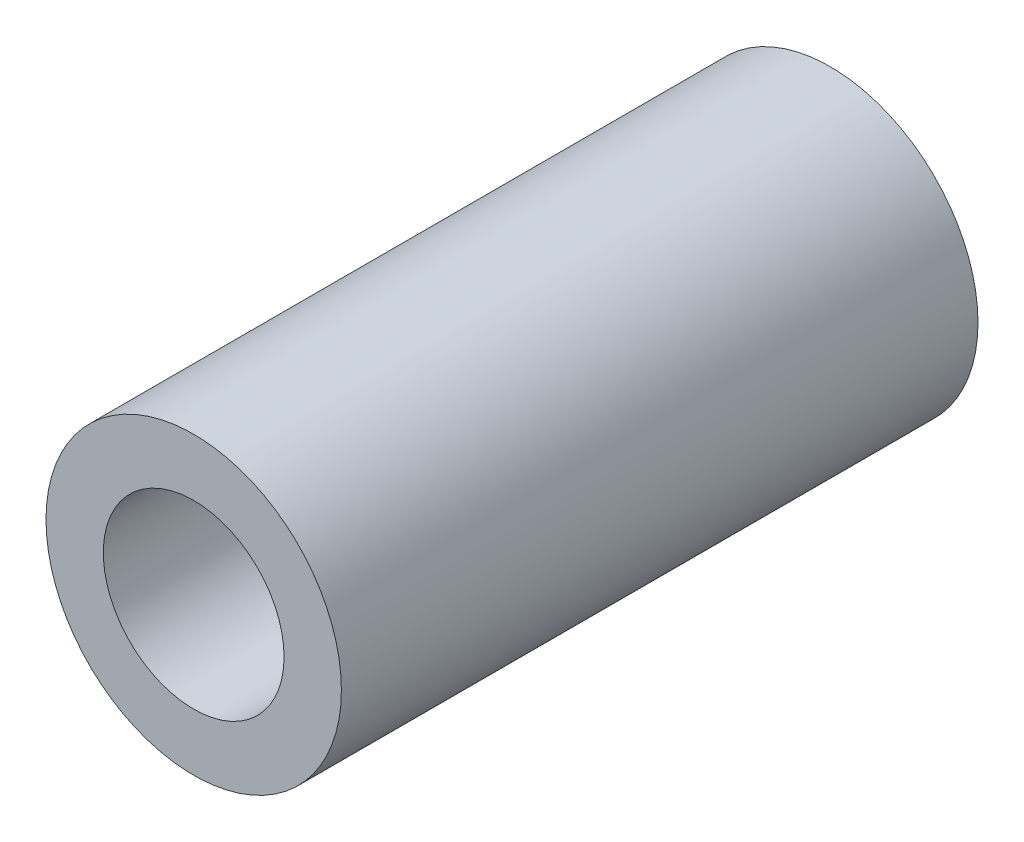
ISO-10303-21;
HEADER;
FILE_DESCRIPTION(('STEP AP214'),'2;1');
FILE_NAME('part.step','',(''),(''),'','','');
FILE_SCHEMA(('AUTOMOTIVE_DESIGN { 1 0 10303 214 1 1 1 1 }'));
ENDSEC;
DATA;
#1=APPLICATION_CONTEXT('core data for automotive mechanical design processes');
#2=APPLICATION_PROTOCOL_DEFINITION('international standard','automotive_design',2000,#1);
#3=PRODUCT_CONTEXT('',#1,'mechanical');
#4=PRODUCT('Part','Part','',(#3));
#5=PRODUCT_RELATED_PRODUCT_CATEGORY('part','',(#4));
#6=PRODUCT_DEFINITION_FORMATION('','',#4);
#7=PRODUCT_DEFINITION_CONTEXT('part definition',#1,'design');
#8=PRODUCT_DEFINITION('design','',#6,#7);
#9=PRODUCT_DEFINITION_SHAPE('','',#8);
#10=(LENGTH_UNIT() NAMED_UNIT(*) SI_UNIT(.MILLI.,.METRE.));
#11=(NAMED_UNIT(*) PLANE_ANGLE_UNIT() SI_UNIT($,.RADIAN.));
#12=(NAMED_UNIT(*) SI_UNIT($,.STERADIAN.) SOLID_ANGLE_UNIT());
#13=UNCERTAINTY_MEASURE_WITH_UNIT(LENGTH_MEASURE(1.E-05),#10,'distance_accuracy_value','');
#14=(GEOMETRIC_REPRESENTATION_CONTEXT(3) GLOBAL_UNCERTAINTY_ASSIGNED_CONTEXT((#13)) GLOBAL_UNIT_ASSIGNED_CONTEXT((#10,
#11,#12)) REPRESENTATION_CONTEXT('',''));
#15=CARTESIAN_POINT('',(0.,0.,0.));
#16=DIRECTION('',(0.,0.,1.));
#17=DIRECTION('',(1.,0.,0.));
#18=AXIS2_PLACEMENT_3D('',#15,#16,#17);
#19=CARTESIAN_POINT('',(0.,0.,50.));
#20=DIRECTION('',(0.,0.,-1.));
#21=DIRECTION('',(-1.,0.,0.));
#22=AXIS2_PLACEMENT_3D('',#19,#20,#21);
#23=CYLINDRICAL_SURFACE('',#22,4.6);
#24=CARTESIAN_POINT('',(0.,0.,0.));
#25=DIRECTION('',(0.,0.,1.));
#26=DIRECTION('',(1.,0.,0.));
#27=AXIS2_PLACEMENT_3D('',#24,#25,#26);
#28=CIRCLE('',#27,4.6);
#29=CARTESIAN_POINT('',(4.6,0.,0.));
#30=VERTEX_POINT('',#29);
#31=EDGE_CURVE('E43',#30,#30,#28,.T.);
#32=ORIENTED_EDGE('',*,*,#31,.F.);
#33=EDGE_LOOP('',(#32));
#34=FACE_BOUND('',#33,.T.);
#35=CARTESIAN_POINT('',(0.,0.,30.));
#36=DIRECTION('',(0.,0.,1.));
#37=DIRECTION('',(1.,0.,0.));
#38=AXIS2_PLACEMENT_3D('',#35,#36,#37);
#39=CIRCLE('',#38,4.6);
#40=CARTESIAN_POINT('',(4.6,0.,30.));
#41=VERTEX_POINT('',#40);
#42=EDGE_CURVE('E34',#41,#41,#39,.T.);
#43=ORIENTED_EDGE('',*,*,#42,.T.);
#44=EDGE_LOOP('',(#43));
#45=FACE_BOUND('',#44,.T.);
#46=ADVANCED_FACE('F30',(#34,#45),#23,.F.);
#47=CARTESIAN_POINT('',(0.,0.,50.));
#48=DIRECTION('',(0.,0.,1.));
#49=DIRECTION('',(1.,0.,0.));
#50=AXIS2_PLACEMENT_3D('',#47,#48,#49);
#51=PLANE('',#50);
#52=CARTESIAN_POINT('',(0.,0.,50.));
#53=DIRECTION('',(0.,0.,1.));
#54=DIRECTION('',(1.,0.,0.));
#55=AXIS2_PLACEMENT_3D('',#52,#53,#54);
#56=CIRCLE('',#55,7.1);
#57=CARTESIAN_POINT('',(7.1,0.,50.));
#58=VERTEX_POINT('',#57);
#59=EDGE_CURVE('E47',#58,#58,#56,.T.);
#60=ORIENTED_EDGE('',*,*,#59,.F.);
#61=EDGE_LOOP('',(#60));
#62=FACE_BOUND('',#61,.T.);
#63=CARTESIAN_POINT('',(0.,0.,50.));
#64=DIRECTION('',(0.,0.,1.));
#65=DIRECTION('',(1.,0.,0.));
#66=AXIS2_PLACEMENT_3D('',#63,#64,#65);
#67=CIRCLE('',#66,11.6);
#68=CARTESIAN_POINT('',(11.6,0.,50.));
#69=VERTEX_POINT('',#68);
#70=EDGE_CURVE('E10',#69,#69,#67,.T.);
#71=ORIENTED_EDGE('',*,*,#70,.T.);
#72=EDGE_LOOP('',(#71));
#73=FACE_BOUND('',#72,.T.);
#74=ADVANCED_FACE('F68',(#62,#73),#51,.T.);
#75=CARTESIAN_POINT('',(0.,0.,0.));
#76=DIRECTION('',(0.,0.,1.));
#77=DIRECTION('',(1.,0.,0.));
#78=AXIS2_PLACEMENT_3D('',#75,#76,#77);
#79=PLANE('',#78);
#80=CARTESIAN_POINT('',(0.,0.,0.));
#81=DIRECTION('',(0.,0.,1.));
#82=DIRECTION('',(1.,0.,0.));
#83=AXIS2_PLACEMENT_3D('',#80,#81,#82);
#84=CIRCLE('',#83,11.6);
#85=CARTESIAN_POINT('',(11.6,0.,0.));
#86=VERTEX_POINT('',#85);
#87=EDGE_CURVE('E38',#86,#86,#84,.T.);
#88=ORIENTED_EDGE('',*,*,#87,.F.);
#89=EDGE_LOOP('',(#88));
#90=FACE_BOUND('',#89,.T.);
#91=ORIENTED_EDGE('',*,*,#31,.T.);
#92=EDGE_LOOP('',(#91));
#93=FACE_BOUND('',#92,.T.);
#94=ADVANCED_FACE('F74',(#90,#93),#79,.F.);
#95=CARTESIAN_POINT('',(0.,0.,50.));
#96=DIRECTION('',(0.,0.,-1.));
#97=DIRECTION('',(-1.,0.,0.));
#98=AXIS2_PLACEMENT_3D('',#95,#96,#97);
#99=CYLINDRICAL_SURFACE('',#98,11.6);
#100=ORIENTED_EDGE('',*,*,#70,.F.);
#101=EDGE_LOOP('',(#100));
#102=FACE_BOUND('',#101,.T.);
#103=ORIENTED_EDGE('',*,*,#87,.T.);
#104=EDGE_LOOP('',(#103));
#105=FACE_BOUND('',#104,.T.);
#106=ADVANCED_FACE('F32',(#102,#105),#99,.T.);
#107=CARTESIAN_POINT('',(0.,0.,30.));
#108=DIRECTION('',(0.,0.,1.));
#109=DIRECTION('',(1.,0.,0.));
#110=AXIS2_PLACEMENT_3D('',#107,#108,#109);
#111=CYLINDRICAL_SURFACE('',#110,7.1);
#112=CARTESIAN_POINT('',(0.,0.,30.));
#113=DIRECTION('',(0.,0.,1.));
#114=DIRECTION('',(1.,0.,0.));
#115=AXIS2_PLACEMENT_3D('',#112,#113,#114);
#116=CIRCLE('',#115,7.1);
#117=CARTESIAN_POINT('',(7.1,0.,30.));
#118=VERTEX_POINT('',#117);
#119=EDGE_CURVE('E50',#118,#118,#116,.T.);
#120=ORIENTED_EDGE('',*,*,#119,.F.);
#121=EDGE_LOOP('',(#120));
#122=FACE_BOUND('',#121,.T.);
#123=ORIENTED_EDGE('',*,*,#59,.T.);
#124=EDGE_LOOP('',(#123));
#125=FACE_BOUND('',#124,.T.);
#126=ADVANCED_FACE('F60',(#122,#125),#111,.F.);
#127=CARTESIAN_POINT('',(0.,0.,30.));
#128=DIRECTION('',(0.,0.,1.));
#129=DIRECTION('',(1.,0.,0.));
#130=AXIS2_PLACEMENT_3D('',#127,#128,#129);
#131=PLANE('',#130);
#132=ORIENTED_EDGE('',*,*,#42,.F.);
#133=EDGE_LOOP('',(#132));
#134=FACE_BOUND('',#133,.T.);
#135=ORIENTED_EDGE('',*,*,#119,.T.);
#136=EDGE_LOOP('',(#135));
#137=FACE_BOUND('',#136,.T.);
#138=ADVANCED_FACE('F58',(#134,#137),#131,.T.);
#139=CLOSED_SHELL('',(#46,#74,#94,#106,#126,#138));
#140=MANIFOLD_SOLID_BREP('B2',#139);
#141=ADVANCED_BREP_SHAPE_REPRESENTATION('',(#18,#140),#14);
#142=SHAPE_DEFINITION_REPRESENTATION(#9,#141);
ENDSEC;
END-ISO-10303-21;
